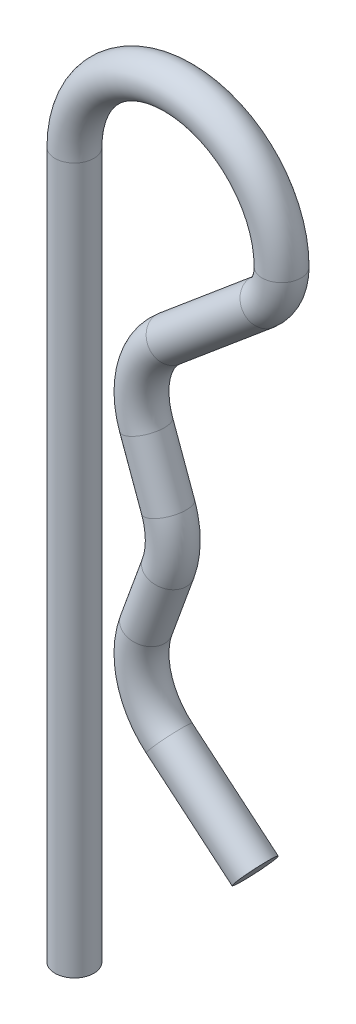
ISO-10303-21;
HEADER;
FILE_DESCRIPTION(('STEP AP214'),'2;1');
FILE_NAME('part.step','',(''),(''),'','','');
FILE_SCHEMA(('AUTOMOTIVE_DESIGN { 1 0 10303 214 1 1 1 1 }'));
ENDSEC;
DATA;
#1=APPLICATION_CONTEXT('core data for automotive mechanical design processes');
#2=APPLICATION_PROTOCOL_DEFINITION('international standard','automotive_design',2000,#1);
#3=PRODUCT_CONTEXT('',#1,'mechanical');
#4=PRODUCT('Part','Part','',(#3));
#5=PRODUCT_RELATED_PRODUCT_CATEGORY('part','',(#4));
#6=PRODUCT_DEFINITION_FORMATION('','',#4);
#7=PRODUCT_DEFINITION_CONTEXT('part definition',#1,'design');
#8=PRODUCT_DEFINITION('design','',#6,#7);
#9=PRODUCT_DEFINITION_SHAPE('','',#8);
#10=(LENGTH_UNIT() NAMED_UNIT(*) SI_UNIT(.MILLI.,.METRE.));
#11=(NAMED_UNIT(*) PLANE_ANGLE_UNIT() SI_UNIT($,.RADIAN.));
#12=(NAMED_UNIT(*) SI_UNIT($,.STERADIAN.) SOLID_ANGLE_UNIT());
#13=UNCERTAINTY_MEASURE_WITH_UNIT(LENGTH_MEASURE(1.E-05),#10,'distance_accuracy_value','');
#14=(GEOMETRIC_REPRESENTATION_CONTEXT(3) GLOBAL_UNCERTAINTY_ASSIGNED_CONTEXT((#13)) GLOBAL_UNIT_ASSIGNED_CONTEXT((#10,
#11,#12)) REPRESENTATION_CONTEXT('',''));
#15=CARTESIAN_POINT('',(0.,0.,0.));
#16=DIRECTION('',(0.,0.,1.));
#17=DIRECTION('',(1.,0.,0.));
#18=AXIS2_PLACEMENT_3D('',#15,#16,#17);
#19=CARTESIAN_POINT('',(13.9574401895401,-18.9208581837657,-5.55111512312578E-13));
#20=DIRECTION('',(-0.766044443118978,0.642787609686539,0.));
#21=DIRECTION('',(-0.642787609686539,-0.766044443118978,0.));
#22=AXIS2_PLACEMENT_3D('',#19,#20,#21);
#23=PLANE('',#22);
#24=CARTESIAN_POINT('',(13.9574401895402,-18.9208581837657,9.99200722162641E-13));
#25=DIRECTION('',(0.766044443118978,-0.642787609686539,0.));
#26=DIRECTION('',(0.642787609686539,0.766044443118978,0.));
#27=AXIS2_PLACEMENT_3D('',#24,#25,#26);
#28=CIRCLE('',#27,1.5);
#29=CARTESIAN_POINT('',(14.92162160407,-17.7717915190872,9.99200722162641E-13));
#30=VERTEX_POINT('',#29);
#31=EDGE_CURVE('E29',#30,#30,#28,.F.);
#32=ORIENTED_EDGE('',*,*,#31,.F.);
#33=EDGE_LOOP('',(#32));
#34=FACE_BOUND('',#33,.T.);
#35=ADVANCED_FACE('F25',(#34),#23,.F.);
#36=CARTESIAN_POINT('',(10.9467518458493,-16.3945907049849,9.99200722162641E-13));
#37=DIRECTION('',(0.766044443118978,-0.642787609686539,0.));
#38=DIRECTION('',(0.642787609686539,0.766044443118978,0.));
#39=AXIS2_PLACEMENT_3D('',#36,#37,#38);
#40=CYLINDRICAL_SURFACE('',#39,1.5);
#41=CARTESIAN_POINT('',(7.32235325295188,-13.3533591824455,9.99200722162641E-13));
#42=DIRECTION('',(-0.766044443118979,0.642787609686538,0.));
#43=DIRECTION('',(-0.642787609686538,-0.766044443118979,0.));
#44=AXIS2_PLACEMENT_3D('',#41,#42,#43);
#45=CIRCLE('',#44,1.5);
#46=CARTESIAN_POINT('',(6.35817183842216,-14.5024258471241,9.99200722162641E-13));
#47=VERTEX_POINT('',#46);
#48=EDGE_CURVE('E40',#47,#47,#45,.T.);
#49=ORIENTED_EDGE('',*,*,#48,.F.);
#50=EDGE_LOOP('',(#49));
#51=FACE_BOUND('',#50,.T.);
#52=ORIENTED_EDGE('',*,*,#31,.T.);
#53=EDGE_LOOP('',(#52));
#54=FACE_BOUND('',#53,.T.);
#55=ADVANCED_FACE('F149',(#51,#54),#40,.T.);
#56=CARTESIAN_POINT('',(11.179078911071,-8.75709252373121,9.99200722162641E-13));
#57=DIRECTION('',(0.,0.,1.));
#58=DIRECTION('',(0.,-1.,0.));
#59=AXIS2_PLACEMENT_3D('',#56,#57,#58);
#60=TOROIDAL_SURFACE('',#59,6.00000000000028,1.5);
#61=CARTESIAN_POINT('',(5.54092318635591,-6.7049716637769,5.55111512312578E-13));
#62=DIRECTION('',(-0.342020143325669,-0.939692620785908,0.));
#63=DIRECTION('',(0.939692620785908,-0.342020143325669,0.));
#64=AXIS2_PLACEMENT_3D('',#61,#62,#63);
#65=CIRCLE('',#64,1.5);
#66=CARTESIAN_POINT('',(4.13138425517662,-6.19194144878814,4.44089209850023E-13));
#67=VERTEX_POINT('',#66);
#68=EDGE_CURVE('E43',#67,#67,#65,.F.);
#69=CARTESIAN_POINT('',(11.179078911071,-8.75709252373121,9.99200722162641E-13));
#70=DIRECTION('',(0.,0.,1.));
#71=DIRECTION('',(0.,-1.,0.));
#72=AXIS2_PLACEMENT_3D('',#69,#70,#71);
#73=CIRCLE('',#72,7.50000000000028);
#74=EDGE_CURVE('',#67,#47,#73,.T.);
#75=ORIENTED_EDGE('',*,*,#68,.F.);
#76=ORIENTED_EDGE('',*,*,#48,.T.);
#77=ORIENTED_EDGE('',*,*,#74,.T.);
#78=ORIENTED_EDGE('',*,*,#74,.F.);
#79=EDGE_LOOP('',(#75,#77,#76,#78));
#80=FACE_BOUND('',#79,.T.);
#81=ADVANCED_FACE('F141',(#80),#60,.T.);
#82=CARTESIAN_POINT('',(6.38767278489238,-4.37854626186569,5.55111512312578E-13));
#83=DIRECTION('',(-0.342020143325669,-0.939692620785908,0.));
#84=DIRECTION('',(0.939692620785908,-0.342020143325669,0.));
#85=AXIS2_PLACEMENT_3D('',#82,#83,#84);
#86=CYLINDRICAL_SURFACE('',#85,1.5);
#87=CARTESIAN_POINT('',(7.23442238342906,-2.05212085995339,5.55111512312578E-13));
#88=DIRECTION('',(0.342020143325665,0.939692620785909,0.));
#89=DIRECTION('',(-0.939692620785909,0.342020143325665,0.));
#90=AXIS2_PLACEMENT_3D('',#87,#88,#89);
#91=CIRCLE('',#90,1.5);
#92=CARTESIAN_POINT('',(5.82488345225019,-1.53909064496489,5.55111512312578E-13));
#93=VERTEX_POINT('',#92);
#94=EDGE_CURVE('E46',#93,#93,#91,.T.);
#95=ORIENTED_EDGE('',*,*,#94,.F.);
#96=EDGE_LOOP('',(#95));
#97=FACE_BOUND('',#96,.T.);
#98=ORIENTED_EDGE('',*,*,#68,.T.);
#99=EDGE_LOOP('',(#98));
#100=FACE_BOUND('',#99,.T.);
#101=ADVANCED_FACE('F133',(#97,#100),#86,.T.);
#102=CARTESIAN_POINT('',(1.59626665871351,1.12410081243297E-12,5.55111512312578E-13));
#103=DIRECTION('',(0.,0.,1.));
#104=DIRECTION('',(1.,0.,0.));
#105=AXIS2_PLACEMENT_3D('',#102,#103,#104);
#106=TOROIDAL_SURFACE('',#105,6.00000000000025,1.5);
#107=ORIENTED_EDGE('',*,*,#94,.T.);
#108=EDGE_LOOP('',(#107));
#109=FACE_BOUND('',#108,.T.);
#110=CARTESIAN_POINT('',(7.23442238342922,2.05212085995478,6.66133814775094E-13));
#111=DIRECTION('',(-0.34202014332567,0.939692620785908,0.));
#112=DIRECTION('',(-0.939692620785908,-0.34202014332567,0.));
#113=AXIS2_PLACEMENT_3D('',#110,#111,#112);
#114=CIRCLE('',#113,1.5);
#115=CARTESIAN_POINT('',(5.82488345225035,1.53909064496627,6.65962026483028E-13));
#116=VERTEX_POINT('',#115);
#117=EDGE_CURVE('E51',#116,#116,#114,.T.);
#118=ORIENTED_EDGE('',*,*,#117,.F.);
#119=EDGE_LOOP('',(#118));
#120=FACE_BOUND('',#119,.T.);
#121=ADVANCED_FACE('F126',(#109,#120),#106,.T.);
#122=CARTESIAN_POINT('',(6.38767278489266,4.37854626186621,6.66133814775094E-13));
#123=DIRECTION('',(-0.34202014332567,0.939692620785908,0.));
#124=DIRECTION('',(-0.939692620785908,-0.34202014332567,0.));
#125=AXIS2_PLACEMENT_3D('',#122,#123,#124);
#126=CYLINDRICAL_SURFACE('',#125,1.5);
#127=CARTESIAN_POINT('',(5.54092318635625,6.70497166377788,6.10622663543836E-13));
#128=DIRECTION('',(-0.342020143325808,0.939692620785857,0.));
#129=DIRECTION('',(-0.939692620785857,-0.342020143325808,0.));
#130=AXIS2_PLACEMENT_3D('',#127,#128,#129);
#131=CIRCLE('',#130,1.5);
#132=CARTESIAN_POINT('',(4.13138425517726,6.1919414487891,6.6630560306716E-13));
#133=VERTEX_POINT('',#132);
#134=EDGE_CURVE('E54',#133,#133,#131,.T.);
#135=CARTESIAN_POINT('',(5.82488345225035,1.53909064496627,6.65962026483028E-13));
#136=CARTESIAN_POINT('',(5.80724283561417,1.58755784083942,6.65965605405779E-13));
#137=CARTESIAN_POINT('',(5.78960221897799,1.63602503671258,6.6596918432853E-13));
#138=CARTESIAN_POINT('',(5.75432098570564,1.73295942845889,6.65976342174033E-13));
#139=CARTESIAN_POINT('',(5.73668036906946,1.78142662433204,6.65979921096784E-13));
#140=CARTESIAN_POINT('',(5.7013991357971,1.87836101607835,6.65987078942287E-13));
#141=CARTESIAN_POINT('',(5.68375851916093,1.9268282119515,6.65990657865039E-13));
#142=CARTESIAN_POINT('',(5.64847728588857,2.02376260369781,6.65997815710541E-13));
#143=CARTESIAN_POINT('',(5.63083666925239,2.07222979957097,6.66001394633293E-13));
#144=CARTESIAN_POINT('',(5.59555543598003,2.16916419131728,6.66008552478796E-13));
#145=CARTESIAN_POINT('',(5.57791481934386,2.21763138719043,6.66012131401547E-13));
#146=CARTESIAN_POINT('',(5.5426335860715,2.31456577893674,6.6601928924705E-13));
#147=CARTESIAN_POINT('',(5.52499296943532,2.36303297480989,6.66022868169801E-13));
#148=CARTESIAN_POINT('',(5.48971173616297,2.4599673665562,6.66030026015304E-13));
#149=CARTESIAN_POINT('',(5.47207111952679,2.50843456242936,6.66033604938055E-13));
#150=CARTESIAN_POINT('',(5.43678988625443,2.60536895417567,6.66040762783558E-13));
#151=CARTESIAN_POINT('',(5.41914926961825,2.65383615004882,6.66044341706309E-13));
#152=CARTESIAN_POINT('',(5.3838680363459,2.75077054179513,6.66051499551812E-13));
#153=CARTESIAN_POINT('',(5.36622741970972,2.79923773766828,6.66055078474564E-13));
#154=CARTESIAN_POINT('',(5.33094618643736,2.89617212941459,6.66062236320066E-13));
#155=CARTESIAN_POINT('',(5.31330556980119,2.94463932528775,6.66065815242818E-13));
#156=CARTESIAN_POINT('',(5.27802433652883,3.04157371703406,6.6607297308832E-13));
#157=CARTESIAN_POINT('',(5.26038371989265,3.09004091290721,6.66076552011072E-13));
#158=CARTESIAN_POINT('',(5.2251024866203,3.18697530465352,6.66083709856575E-13));
#159=CARTESIAN_POINT('',(5.20746186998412,3.23544250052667,6.66087288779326E-13));
#160=CARTESIAN_POINT('',(5.17218063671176,3.33237689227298,6.66094446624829E-13));
#161=CARTESIAN_POINT('',(5.15454002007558,3.38084408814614,6.6609802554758E-13));
#162=CARTESIAN_POINT('',(5.11925878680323,3.47777847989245,6.66105183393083E-13));
#163=CARTESIAN_POINT('',(5.10161817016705,3.5262456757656,6.66108762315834E-13));
#164=CARTESIAN_POINT('',(5.06633693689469,3.62318006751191,6.66115920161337E-13));
#165=CARTESIAN_POINT('',(5.04869632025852,3.67164726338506,6.66119499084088E-13));
#166=CARTESIAN_POINT('',(5.01341508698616,3.76858165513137,6.66126656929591E-13));
#167=CARTESIAN_POINT('',(4.99577447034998,3.81704885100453,6.66130235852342E-13));
#168=CARTESIAN_POINT('',(4.96049323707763,3.91398324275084,6.66137393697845E-13));
#169=CARTESIAN_POINT('',(4.94285262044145,3.96245043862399,6.66140972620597E-13));
#170=CARTESIAN_POINT('',(4.90757138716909,4.0593848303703,6.661481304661E-13));
#171=CARTESIAN_POINT('',(4.88993077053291,4.10785202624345,6.66151709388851E-13));
#172=CARTESIAN_POINT('',(4.85464953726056,4.20478641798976,6.66158867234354E-13));
#173=CARTESIAN_POINT('',(4.83700892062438,4.25325361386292,6.66162446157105E-13));
#174=CARTESIAN_POINT('',(4.80172768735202,4.35018800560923,6.66169604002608E-13));
#175=CARTESIAN_POINT('',(4.78408707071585,4.39865520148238,6.66173182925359E-13));
#176=CARTESIAN_POINT('',(4.74880583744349,4.49558959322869,6.66180340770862E-13));
#177=CARTESIAN_POINT('',(4.73116522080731,4.54405678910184,6.66183919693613E-13));
#178=CARTESIAN_POINT('',(4.69588398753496,4.64099118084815,6.66191077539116E-13));
#179=CARTESIAN_POINT('',(4.67824337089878,4.68945837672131,6.66194656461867E-13));
#180=CARTESIAN_POINT('',(4.64296213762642,4.78639276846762,6.6620181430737E-13));
#181=CARTESIAN_POINT('',(4.62532152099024,4.83485996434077,6.66205393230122E-13));
#182=CARTESIAN_POINT('',(4.59004028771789,4.93179435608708,6.66212551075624E-13));
#183=CARTESIAN_POINT('',(4.57239967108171,4.98026155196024,6.66216129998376E-13));
#184=CARTESIAN_POINT('',(4.53711843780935,5.07719594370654,6.66223287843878E-13));
#185=CARTESIAN_POINT('',(4.51947782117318,5.1256631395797,6.6622686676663E-13));
#186=CARTESIAN_POINT('',(4.48419658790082,5.22259753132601,6.66234024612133E-13));
#187=CARTESIAN_POINT('',(4.46655597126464,5.27106472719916,6.66237603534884E-13));
#188=CARTESIAN_POINT('',(4.43127473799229,5.36799911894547,6.66244761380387E-13));
#189=CARTESIAN_POINT('',(4.41363412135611,5.41646631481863,6.66248340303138E-13));
#190=CARTESIAN_POINT('',(4.37835288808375,5.51340070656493,6.66255498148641E-13));
#191=CARTESIAN_POINT('',(4.36071227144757,5.56186790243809,6.66259077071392E-13));
#192=CARTESIAN_POINT('',(4.32543103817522,5.6588022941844,6.66266234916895E-13));
#193=CARTESIAN_POINT('',(4.30779042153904,5.70726949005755,6.66269813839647E-13));
#194=CARTESIAN_POINT('',(4.27250918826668,5.80420388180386,6.66276971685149E-13));
#195=CARTESIAN_POINT('',(4.2548685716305,5.85267107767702,6.66280550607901E-13));
#196=CARTESIAN_POINT('',(4.21958733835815,5.94960546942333,6.66287708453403E-13));
#197=CARTESIAN_POINT('',(4.20194672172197,5.99807266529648,6.66291287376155E-13));
#198=CARTESIAN_POINT('',(4.16666548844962,6.09500705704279,6.66298445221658E-13));
#199=CARTESIAN_POINT('',(4.14902487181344,6.14347425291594,6.66302024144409E-13));
#200=CARTESIAN_POINT('',(4.13138425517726,6.1919414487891,6.6630560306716E-13));
#201=B_SPLINE_CURVE_WITH_KNOTS('',3,(#135,#136,#137,#138,#139,#140,#141,#142,#143,#144,#145,
#146,#147,#148,#149,#150,#151,#152,#153,#154,#155,#156,#157,#158,#159,#160,#161,#162,#163,#164,
#165,#166,#167,#168,#169,#170,#171,#172,#173,#174,#175,#176,#177,#178,#179,#180,#181,#182,#183,
#184,#185,#186,#187,#188,#189,#190,#191,#192,#193,#194,#195,#196,#197,#198,#199,#200),
.UNSPECIFIED.,.F.,.F.,(4,2,2,2,2,2,2,2,2,2,2,2,2,2,2,2,2,2,2,2,2,2,2,2,2,2,2,2,2,2,2,2,4),(0.,
0.154733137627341,0.309466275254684,0.464199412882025,0.618932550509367,0.773665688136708,
0.92839882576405,1.08313196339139,1.23786510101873,1.39259823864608,1.54733137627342,
1.70206451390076,1.8567976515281,2.01153078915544,2.16626392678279,2.32099706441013,
2.47573020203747,2.63046333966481,2.78519647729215,2.93992961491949,3.09466275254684,
3.24939589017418,3.40412902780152,3.55886216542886,3.7135953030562,3.86832844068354,
4.02306157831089,4.17779471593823,4.33252785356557,4.48726099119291,4.64199412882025,
4.79672726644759,4.95146040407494),.UNSPECIFIED.);
#202=EDGE_CURVE('BSEAM82',#116,#133,#201,.T.);
#203=ORIENTED_EDGE('',*,*,#117,.T.);
#204=ORIENTED_EDGE('',*,*,#134,.F.);
#205=ORIENTED_EDGE('',*,*,#202,.T.);
#206=ORIENTED_EDGE('',*,*,#202,.F.);
#207=EDGE_LOOP('',(#203,#205,#204,#206));
#208=FACE_BOUND('',#207,.T.);
#209=ADVANCED_FACE('F82',(#208),#126,.T.);
#210=CARTESIAN_POINT('',(11.179078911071,8.75709252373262,6.10622663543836E-13));
#211=DIRECTION('',(0.,0.,-1.));
#212=DIRECTION('',(0.,1.,0.));
#213=AXIS2_PLACEMENT_3D('',#210,#211,#212);
#214=TOROIDAL_SURFACE('',#213,5.99999999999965,1.5);
#215=CARTESIAN_POINT('',(7.32235325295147,13.3533591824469,9.99200722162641E-13));
#216=DIRECTION('',(0.766044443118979,0.642787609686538,0.));
#217=DIRECTION('',(-0.642787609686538,0.766044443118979,0.));
#218=AXIS2_PLACEMENT_3D('',#215,#216,#217);
#219=CIRCLE('',#218,1.5);
#220=CARTESIAN_POINT('',(6.35817183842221,14.5024258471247,1.09634523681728E-12));
#221=VERTEX_POINT('',#220);
#222=EDGE_CURVE('E57',#221,#221,#219,.T.);
#223=CARTESIAN_POINT('',(11.179078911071,8.75709252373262,6.10622663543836E-13));
#224=DIRECTION('',(0.,0.,-1.));
#225=DIRECTION('',(0.,1.,0.));
#226=AXIS2_PLACEMENT_3D('',#223,#224,#225);
#227=CIRCLE('',#226,7.49999999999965);
#228=EDGE_CURVE('',#133,#221,#227,.T.);
#229=ORIENTED_EDGE('',*,*,#134,.T.);
#230=ORIENTED_EDGE('',*,*,#222,.F.);
#231=ORIENTED_EDGE('',*,*,#228,.T.);
#232=ORIENTED_EDGE('',*,*,#228,.F.);
#233=EDGE_LOOP('',(#229,#231,#230,#232));
#234=FACE_BOUND('',#233,.T.);
#235=ADVANCED_FACE('F75',(#234),#214,.T.);
#236=CARTESIAN_POINT('',(10.9467518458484,16.3945907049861,9.99200722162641E-13));
#237=DIRECTION('',(0.766044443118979,0.642787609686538,0.));
#238=DIRECTION('',(-0.642787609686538,0.766044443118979,0.));
#239=AXIS2_PLACEMENT_3D('',#236,#237,#238);
#240=CYLINDRICAL_SURFACE('',#239,1.5);
#241=ORIENTED_EDGE('',*,*,#222,.T.);
#242=EDGE_LOOP('',(#241));
#243=FACE_BOUND('',#242,.T.);
#244=CARTESIAN_POINT('',(14.5711504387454,19.4358222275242,9.99200722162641E-13));
#245=DIRECTION('',(0.766044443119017,0.642787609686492,0.));
#246=DIRECTION('',(-0.642787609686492,0.766044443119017,0.));
#247=AXIS2_PLACEMENT_3D('',#244,#245,#246);
#248=CIRCLE('',#247,1.5);
#249=CARTESIAN_POINT('',(15.5353318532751,18.2867555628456,9.99200722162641E-13));
#250=VERTEX_POINT('',#249);
#251=EDGE_CURVE('E60',#250,#250,#248,.T.);
#252=ORIENTED_EDGE('',*,*,#251,.F.);
#253=EDGE_LOOP('',(#252));
#254=FACE_BOUND('',#253,.T.);
#255=ADVANCED_FACE('F71',(#243,#254),#240,.T.);
#256=CARTESIAN_POINT('',(12.,22.5000000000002,9.99200722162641E-13));
#257=DIRECTION('',(0.,0.,1.));
#258=DIRECTION('',(1.,0.,0.));
#259=AXIS2_PLACEMENT_3D('',#256,#257,#258);
#260=TOROIDAL_SURFACE('',#259,3.99999999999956,1.5);
#261=CARTESIAN_POINT('',(15.9999999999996,22.4999999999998,3.33066907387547E-13));
#262=DIRECTION('',(0.,1.,0.));
#263=DIRECTION('',(0.,0.,1.));
#264=AXIS2_PLACEMENT_3D('',#261,#262,#263);
#265=CIRCLE('',#264,1.5);
#266=CARTESIAN_POINT('',(17.4999999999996,22.4999999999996,0.));
#267=VERTEX_POINT('',#266);
#268=EDGE_CURVE('E37',#267,#267,#265,.T.);
#269=CARTESIAN_POINT('',(12.,22.5000000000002,9.99200722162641E-13));
#270=DIRECTION('',(0.,0.,1.));
#271=DIRECTION('',(1.,0.,0.));
#272=AXIS2_PLACEMENT_3D('',#269,#270,#271);
#273=CIRCLE('',#272,5.49999999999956);
#274=EDGE_CURVE('',#250,#267,#273,.T.);
#275=ORIENTED_EDGE('',*,*,#251,.T.);
#276=ORIENTED_EDGE('',*,*,#268,.F.);
#277=ORIENTED_EDGE('',*,*,#274,.T.);
#278=ORIENTED_EDGE('',*,*,#274,.F.);
#279=EDGE_LOOP('',(#275,#277,#276,#278));
#280=FACE_BOUND('',#279,.T.);
#281=ADVANCED_FACE('F67',(#280),#260,.T.);
#282=CARTESIAN_POINT('',(-3.88578058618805E-13,-31.9999999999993,7.7715611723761E-13));
#283=DIRECTION('',(0.,-1.,0.));
#284=DIRECTION('',(1.,0.,0.));
#285=AXIS2_PLACEMENT_3D('',#282,#283,#284);
#286=PLANE('',#285);
#287=CARTESIAN_POINT('',(-1.52655665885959E-13,-31.9999999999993,1.11022302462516E-12));
#288=DIRECTION('',(0.,-1.,0.));
#289=DIRECTION('',(1.,0.,0.));
#290=AXIS2_PLACEMENT_3D('',#287,#288,#289);
#291=CIRCLE('',#290,1.5);
#292=CARTESIAN_POINT('',(1.49999999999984,-31.9999999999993,1.11022302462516E-12));
#293=VERTEX_POINT('',#292);
#294=EDGE_CURVE('E12',#293,#293,#291,.F.);
#295=ORIENTED_EDGE('',*,*,#294,.F.);
#296=EDGE_LOOP('',(#295));
#297=FACE_BOUND('',#296,.T.);
#298=ADVANCED_FACE('F70',(#297),#286,.T.);
#299=CARTESIAN_POINT('',(8.00000000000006,22.5000000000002,3.33066907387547E-13));
#300=DIRECTION('',(0.,0.,1.));
#301=DIRECTION('',(1.,0.,0.));
#302=AXIS2_PLACEMENT_3D('',#299,#300,#301);
#303=TOROIDAL_SURFACE('',#302,7.99999999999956,1.5);
#304=CARTESIAN_POINT('',(-1.80411241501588E-13,22.5000000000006,1.11022302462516E-12));
#305=DIRECTION('',(0.,-1.,0.));
#306=DIRECTION('',(1.,0.,0.));
#307=AXIS2_PLACEMENT_3D('',#304,#305,#306);
#308=CIRCLE('',#307,1.5);
#309=CARTESIAN_POINT('',(-1.4999999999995,22.5000000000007,1.25593979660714E-12));
#310=VERTEX_POINT('',#309);
#311=EDGE_CURVE('E33',#310,#310,#308,.T.);
#312=CARTESIAN_POINT('',(8.00000000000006,22.5000000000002,3.33066907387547E-13));
#313=DIRECTION('',(0.,0.,1.));
#314=DIRECTION('',(1.,0.,0.));
#315=AXIS2_PLACEMENT_3D('',#312,#313,#314);
#316=CIRCLE('',#315,9.49999999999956);
#317=EDGE_CURVE('',#267,#310,#316,.T.);
#318=ORIENTED_EDGE('',*,*,#268,.T.);
#319=ORIENTED_EDGE('',*,*,#311,.F.);
#320=ORIENTED_EDGE('',*,*,#317,.T.);
#321=ORIENTED_EDGE('',*,*,#317,.F.);
#322=EDGE_LOOP('',(#318,#320,#319,#321));
#323=FACE_BOUND('',#322,.T.);
#324=ADVANCED_FACE('F27',(#323),#303,.T.);
#325=CARTESIAN_POINT('',(-1.52655665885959E-13,-4.74999999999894,1.11022302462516E-12));
#326=DIRECTION('',(0.,-1.,0.));
#327=DIRECTION('',(1.,0.,0.));
#328=AXIS2_PLACEMENT_3D('',#325,#326,#327);
#329=CYLINDRICAL_SURFACE('',#328,1.5);
#330=ORIENTED_EDGE('',*,*,#294,.T.);
#331=EDGE_LOOP('',(#330));
#332=FACE_BOUND('',#331,.T.);
#333=ORIENTED_EDGE('',*,*,#311,.T.);
#334=EDGE_LOOP('',(#333));
#335=FACE_BOUND('',#334,.T.);
#336=ADVANCED_FACE('F87',(#332,#335),#329,.T.);
#337=CLOSED_SHELL('',(#35,#55,#81,#101,#121,#209,#235,#255,#281,#298,#324,#336));
#338=MANIFOLD_SOLID_BREP('B1',#337);
#339=ADVANCED_BREP_SHAPE_REPRESENTATION('',(#18,#338),#14);
#340=SHAPE_DEFINITION_REPRESENTATION(#9,#339);
ENDSEC;
END-ISO-10303-21;
